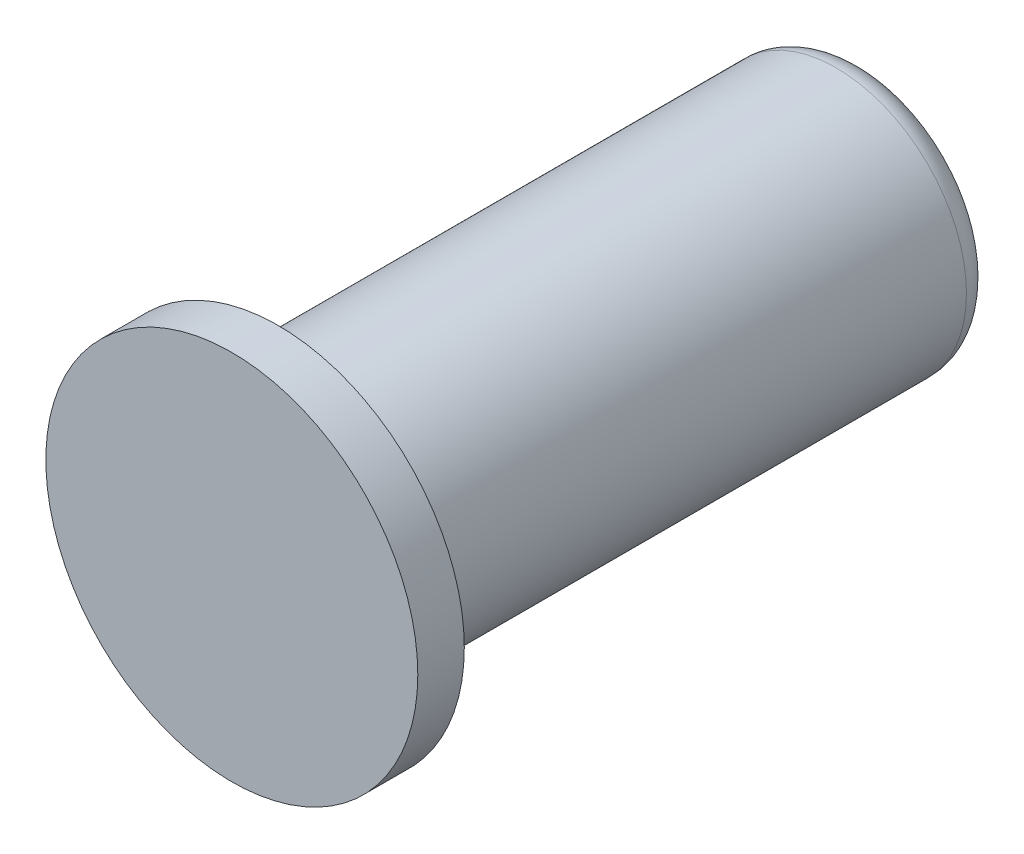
from build123d import *


with BuildPart() as part:
    # Sketch1 → Revolve1 (revolve)
    with BuildSketch(Plane(origin=(0, 0, 0), x_dir=(0, 0, -1), z_dir=(1, 0, 0)), mode=Mode.PRIVATE) as revolve1_sk:
        with BuildLine():
            Line((0, 0), (0, 20))
            Line((0, 20), (5, 20))
            Line((5, 20), (5, 14))
            Line((5, 14), (65, 14))
            ThreePointArc((65, 14), (67.121320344, 13.121320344), (68, 11))
            Line((68, 11), (68, 3.5))
            Line((68, 3.5), (67.5, 3))
            Line((67.5, 3), (59, 3))
            Line((59, 3), (57.267949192, 0))
            Line((57.267949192, 0), (0, 0))
        make_face()
    revolve(revolve1_sk.sketch.rotate(Axis((0, 0, 0), (0, 0, -1)), 90), axis=Axis((0, 0, 0), (0, 0, -1)))


solid = part.part
